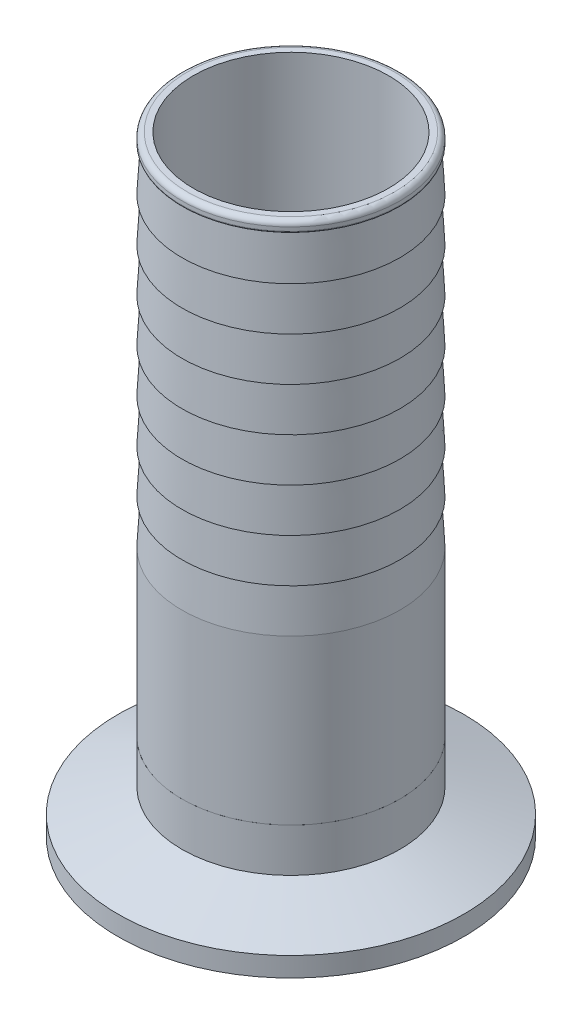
ISO-10303-21;
HEADER;
FILE_DESCRIPTION(('STEP AP214'),'2;1');
FILE_NAME('part.step','',(''),(''),'','','');
FILE_SCHEMA(('AUTOMOTIVE_DESIGN { 1 0 10303 214 1 1 1 1 }'));
ENDSEC;
DATA;
#1=APPLICATION_CONTEXT('core data for automotive mechanical design processes');
#2=APPLICATION_PROTOCOL_DEFINITION('international standard','automotive_design',2000,#1);
#3=PRODUCT_CONTEXT('',#1,'mechanical');
#4=PRODUCT('Part','Part','',(#3));
#5=PRODUCT_RELATED_PRODUCT_CATEGORY('part','',(#4));
#6=PRODUCT_DEFINITION_FORMATION('','',#4);
#7=PRODUCT_DEFINITION_CONTEXT('part definition',#1,'design');
#8=PRODUCT_DEFINITION('design','',#6,#7);
#9=PRODUCT_DEFINITION_SHAPE('','',#8);
#10=(LENGTH_UNIT() NAMED_UNIT(*) SI_UNIT(.MILLI.,.METRE.));
#11=(NAMED_UNIT(*) PLANE_ANGLE_UNIT() SI_UNIT($,.RADIAN.));
#12=(NAMED_UNIT(*) SI_UNIT($,.STERADIAN.) SOLID_ANGLE_UNIT());
#13=UNCERTAINTY_MEASURE_WITH_UNIT(LENGTH_MEASURE(1.E-05),#10,'distance_accuracy_value','');
#14=(GEOMETRIC_REPRESENTATION_CONTEXT(3) GLOBAL_UNCERTAINTY_ASSIGNED_CONTEXT((#13)) GLOBAL_UNIT_ASSIGNED_CONTEXT((#10,
#11,#12)) REPRESENTATION_CONTEXT('',''));
#15=CARTESIAN_POINT('',(0.,0.,0.));
#16=DIRECTION('',(0.,0.,1.));
#17=DIRECTION('',(1.,0.,0.));
#18=AXIS2_PLACEMENT_3D('',#15,#16,#17);
#19=CARTESIAN_POINT('',(26.6455914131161,25.0733038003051,37.8721007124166));
#20=DIRECTION('',(0.,-1.,0.));
#21=DIRECTION('',(0.,0.,-1.));
#22=AXIS2_PLACEMENT_3D('',#19,#20,#21);
#23=TOROIDAL_SURFACE('',#22,15.4178,1.1938);
#24=CARTESIAN_POINT('',(26.6455914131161,25.0733038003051,37.8721007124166));
#25=DIRECTION('',(0.,-1.,0.));
#26=DIRECTION('',(0.,0.,-1.));
#27=AXIS2_PLACEMENT_3D('',#24,#25,#26);
#28=CIRCLE('',#27,14.224);
#29=CARTESIAN_POINT('',(26.6455914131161,25.0733038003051,23.6481007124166));
#30=VERTEX_POINT('',#29);
#31=EDGE_CURVE('P0_E10',#30,#30,#28,.T.);
#32=ORIENTED_EDGE('',*,*,#31,.F.);
#33=EDGE_LOOP('',(#32));
#34=FACE_BOUND('',#33,.T.);
#35=CARTESIAN_POINT('',(26.6455914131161,24.2291597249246,37.8721007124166));
#36=DIRECTION('',(0.,-1.,0.));
#37=DIRECTION('',(0.,0.,-1.));
#38=AXIS2_PLACEMENT_3D('',#35,#36,#37);
#39=CIRCLE('',#38,14.5736559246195);
#40=CARTESIAN_POINT('',(26.6455914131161,24.2291597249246,23.2984447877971));
#41=VERTEX_POINT('',#40);
#42=EDGE_CURVE('P0_E64',#41,#41,#39,.T.);
#43=ORIENTED_EDGE('',*,*,#42,.T.);
#44=EDGE_LOOP('',(#43));
#45=FACE_BOUND('',#44,.T.);
#46=ADVANCED_FACE('P0_F15',(#34,#45),#23,.T.);
#47=CARTESIAN_POINT('',(26.6455914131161,21.4038156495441,37.8721007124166));
#48=DIRECTION('',(0.,-1.,0.));
#49=DIRECTION('',(0.,0.,-1.));
#50=AXIS2_PLACEMENT_3D('',#47,#48,#49);
#51=CYLINDRICAL_SURFACE('',#50,14.224);
#52=CARTESIAN_POINT('',(26.6455914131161,34.1038156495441,37.8721007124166));
#53=DIRECTION('',(0.,-1.,0.));
#54=DIRECTION('',(0.,0.,-1.));
#55=AXIS2_PLACEMENT_3D('',#52,#53,#54);
#56=CIRCLE('',#55,14.224);
#57=CARTESIAN_POINT('',(26.6455914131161,34.1038156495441,23.6481007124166));
#58=VERTEX_POINT('',#57);
#59=EDGE_CURVE('P0_E21',#58,#58,#56,.T.);
#60=ORIENTED_EDGE('',*,*,#59,.F.);
#61=EDGE_LOOP('',(#60));
#62=FACE_BOUND('',#61,.T.);
#63=ORIENTED_EDGE('',*,*,#31,.T.);
#64=EDGE_LOOP('',(#63));
#65=FACE_BOUND('',#64,.T.);
#66=ADVANCED_FACE('P0_F94',(#62,#65),#51,.F.);
#67=CARTESIAN_POINT('',(12.4215914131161,34.1038156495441,37.8721007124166));
#68=DIRECTION('',(0.,-1.,0.));
#69=DIRECTION('',(0.,0.,-1.));
#70=AXIS2_PLACEMENT_3D('',#67,#68,#69);
#71=PLANE('',#70);
#72=CARTESIAN_POINT('',(26.6455914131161,34.1038156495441,37.8721007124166));
#73=DIRECTION('',(0.,-1.,0.));
#74=DIRECTION('',(0.,0.,-1.));
#75=AXIS2_PLACEMENT_3D('',#72,#73,#74);
#76=CIRCLE('',#75,15.875);
#77=CARTESIAN_POINT('',(26.6455914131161,34.1038156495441,21.9971007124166));
#78=VERTEX_POINT('',#77);
#79=EDGE_CURVE('P0_E25',#78,#78,#76,.T.);
#80=ORIENTED_EDGE('',*,*,#79,.F.);
#81=EDGE_LOOP('',(#80));
#82=FACE_BOUND('',#81,.T.);
#83=ORIENTED_EDGE('',*,*,#59,.T.);
#84=EDGE_LOOP('',(#83));
#85=FACE_BOUND('',#84,.T.);
#86=ADVANCED_FACE('P0_F99',(#82,#85),#71,.F.);
#87=CARTESIAN_POINT('',(26.6455914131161,21.4038156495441,37.8721007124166));
#88=DIRECTION('',(0.,-1.,0.));
#89=DIRECTION('',(0.,0.,-1.));
#90=AXIS2_PLACEMENT_3D('',#87,#88,#89);
#91=CYLINDRICAL_SURFACE('',#90,15.875);
#92=CARTESIAN_POINT('',(26.6455914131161,27.7538156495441,37.8721007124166));
#93=DIRECTION('',(0.,-1.,0.));
#94=DIRECTION('',(0.,0.,-1.));
#95=AXIS2_PLACEMENT_3D('',#92,#93,#94);
#96=CIRCLE('',#95,15.875);
#97=CARTESIAN_POINT('',(26.6455914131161,27.7538156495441,21.9971007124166));
#98=VERTEX_POINT('',#97);
#99=EDGE_CURVE('P0_E29',#98,#98,#96,.T.);
#100=ORIENTED_EDGE('',*,*,#99,.F.);
#101=EDGE_LOOP('',(#100));
#102=FACE_BOUND('',#101,.T.);
#103=ORIENTED_EDGE('',*,*,#79,.T.);
#104=EDGE_LOOP('',(#103));
#105=FACE_BOUND('',#104,.T.);
#106=ADVANCED_FACE('P0_F104',(#102,#105),#91,.T.);
#107=CARTESIAN_POINT('',(10.7705914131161,27.7538156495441,37.8721007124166));
#108=DIRECTION('',(0.,1.,0.));
#109=DIRECTION('',(0.,0.,1.));
#110=AXIS2_PLACEMENT_3D('',#107,#108,#109);
#111=PLANE('',#110);
#112=CARTESIAN_POINT('',(26.6455914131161,27.7538156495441,37.8721007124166));
#113=DIRECTION('',(0.,-1.,0.));
#114=DIRECTION('',(0.,0.,-1.));
#115=AXIS2_PLACEMENT_3D('',#112,#113,#114);
#116=CIRCLE('',#115,15.5663421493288);
#117=CARTESIAN_POINT('',(26.6455914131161,27.7538156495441,22.3057585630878));
#118=VERTEX_POINT('',#117);
#119=EDGE_CURVE('P0_E34',#118,#118,#116,.T.);
#120=ORIENTED_EDGE('',*,*,#119,.F.);
#121=EDGE_LOOP('',(#120));
#122=FACE_BOUND('',#121,.T.);
#123=ORIENTED_EDGE('',*,*,#99,.T.);
#124=EDGE_LOOP('',(#123));
#125=FACE_BOUND('',#124,.T.);
#126=ADVANCED_FACE('P0_F110',(#122,#125),#111,.F.);
#127=CARTESIAN_POINT('',(26.6455914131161,27.7538156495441,37.8721007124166));
#128=DIRECTION('',(0.,-1.,0.));
#129=DIRECTION('',(0.,0.,-1.));
#130=AXIS2_PLACEMENT_3D('',#127,#128,#129);
#131=CONICAL_SURFACE('',#130,15.5663421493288,1.22173047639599);
#132=CARTESIAN_POINT('',(26.6455914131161,24.2486156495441,37.8721007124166));
#133=DIRECTION('',(0.,-1.,0.));
#134=DIRECTION('',(0.,0.,-1.));
#135=AXIS2_PLACEMENT_3D('',#132,#133,#134);
#136=CIRCLE('',#135,25.1968);
#137=CARTESIAN_POINT('',(26.6455914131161,24.2486156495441,12.6753007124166));
#138=VERTEX_POINT('',#137);
#139=EDGE_CURVE('P0_E37',#138,#138,#136,.T.);
#140=ORIENTED_EDGE('',*,*,#139,.F.);
#141=EDGE_LOOP('',(#140));
#142=FACE_BOUND('',#141,.T.);
#143=ORIENTED_EDGE('',*,*,#119,.T.);
#144=EDGE_LOOP('',(#143));
#145=FACE_BOUND('',#144,.T.);
#146=ADVANCED_FACE('P0_F114',(#142,#145),#131,.T.);
#147=CARTESIAN_POINT('',(26.6455914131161,21.4038156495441,37.8721007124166));
#148=DIRECTION('',(0.,-1.,0.));
#149=DIRECTION('',(0.,0.,-1.));
#150=AXIS2_PLACEMENT_3D('',#147,#148,#149);
#151=CYLINDRICAL_SURFACE('',#150,25.1968);
#152=CARTESIAN_POINT('',(26.6455914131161,21.4038156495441,37.8721007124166));
#153=DIRECTION('',(0.,-1.,0.));
#154=DIRECTION('',(0.,0.,-1.));
#155=AXIS2_PLACEMENT_3D('',#152,#153,#154);
#156=CIRCLE('',#155,25.1968);
#157=CARTESIAN_POINT('',(26.6455914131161,21.4038156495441,12.6753007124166));
#158=VERTEX_POINT('',#157);
#159=EDGE_CURVE('P0_E40',#158,#158,#156,.T.);
#160=ORIENTED_EDGE('',*,*,#159,.F.);
#161=EDGE_LOOP('',(#160));
#162=FACE_BOUND('',#161,.T.);
#163=ORIENTED_EDGE('',*,*,#139,.T.);
#164=EDGE_LOOP('',(#163));
#165=FACE_BOUND('',#164,.T.);
#166=ADVANCED_FACE('P0_F118',(#162,#165),#151,.T.);
#167=CARTESIAN_POINT('',(1.44879141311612,21.4038156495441,37.8721007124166));
#168=DIRECTION('',(0.,1.,0.));
#169=DIRECTION('',(0.,0.,1.));
#170=AXIS2_PLACEMENT_3D('',#167,#168,#169);
#171=PLANE('',#170);
#172=CARTESIAN_POINT('',(26.6455914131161,21.4038156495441,37.8721007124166));
#173=DIRECTION('',(0.,-1.,0.));
#174=DIRECTION('',(0.,0.,-1.));
#175=AXIS2_PLACEMENT_3D('',#172,#173,#174);
#176=CIRCLE('',#175,24.2165908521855);
#177=CARTESIAN_POINT('',(26.6455914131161,21.4038156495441,13.655509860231));
#178=VERTEX_POINT('',#177);
#179=EDGE_CURVE('P0_E43',#178,#178,#176,.T.);
#180=ORIENTED_EDGE('',*,*,#179,.F.);
#181=EDGE_LOOP('',(#180));
#182=FACE_BOUND('',#181,.T.);
#183=ORIENTED_EDGE('',*,*,#159,.T.);
#184=EDGE_LOOP('',(#183));
#185=FACE_BOUND('',#184,.T.);
#186=ADVANCED_FACE('P0_F122',(#182,#185),#171,.F.);
#187=CARTESIAN_POINT('',(26.6455914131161,22.1912156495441,37.8721007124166));
#188=DIRECTION('',(0.,-1.,0.));
#189=DIRECTION('',(0.,0.,-1.));
#190=AXIS2_PLACEMENT_3D('',#187,#188,#189);
#191=TOROIDAL_SURFACE('',#190,24.2165908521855,0.7874);
#192=ORIENTED_EDGE('',*,*,#179,.T.);
#193=EDGE_LOOP('',(#192));
#194=FACE_BOUND('',#193,.T.);
#195=CARTESIAN_POINT('',(26.6455914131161,21.6344397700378,37.8721007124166));
#196=DIRECTION('',(0.,-1.,0.));
#197=DIRECTION('',(0.,0.,-1.));
#198=AXIS2_PLACEMENT_3D('',#195,#196,#197);
#199=CIRCLE('',#198,23.6598149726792);
#200=CARTESIAN_POINT('',(26.6455914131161,21.6344397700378,14.2122857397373));
#201=VERTEX_POINT('',#200);
#202=EDGE_CURVE('P0_E46',#201,#201,#199,.T.);
#203=ORIENTED_EDGE('',*,*,#202,.F.);
#204=EDGE_LOOP('',(#203));
#205=FACE_BOUND('',#204,.T.);
#206=ADVANCED_FACE('P0_F126',(#194,#205),#191,.T.);
#207=CARTESIAN_POINT('',(26.6455914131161,21.6344397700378,37.8721007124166));
#208=DIRECTION('',(0.,-1.,0.));
#209=DIRECTION('',(0.,0.,-1.));
#210=AXIS2_PLACEMENT_3D('',#207,#208,#209);
#211=CONICAL_SURFACE('',#210,23.6598149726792,0.78539816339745);
#212=CARTESIAN_POINT('',(26.6455914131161,22.6315106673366,37.8721007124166));
#213=DIRECTION('',(0.,-1.,0.));
#214=DIRECTION('',(0.,0.,-1.));
#215=AXIS2_PLACEMENT_3D('',#212,#213,#214);
#216=CIRCLE('',#215,22.6627440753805);
#217=CARTESIAN_POINT('',(26.6455914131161,22.6315106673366,15.2093566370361));
#218=VERTEX_POINT('',#217);
#219=EDGE_CURVE('P0_E49',#218,#218,#216,.T.);
#220=ORIENTED_EDGE('',*,*,#219,.F.);
#221=EDGE_LOOP('',(#220));
#222=FACE_BOUND('',#221,.T.);
#223=ORIENTED_EDGE('',*,*,#202,.T.);
#224=EDGE_LOOP('',(#223));
#225=FACE_BOUND('',#224,.T.);
#226=ADVANCED_FACE('P0_F130',(#222,#225),#211,.F.);
#227=CARTESIAN_POINT('',(26.6455914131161,21.7873665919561,37.8721007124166));
#228=DIRECTION('',(0.,-1.,0.));
#229=DIRECTION('',(0.,0.,-1.));
#230=AXIS2_PLACEMENT_3D('',#227,#228,#229);
#231=TOROIDAL_SURFACE('',#230,21.8186,1.1938);
#232=ORIENTED_EDGE('',*,*,#219,.T.);
#233=EDGE_LOOP('',(#232));
#234=FACE_BOUND('',#233,.T.);
#235=CARTESIAN_POINT('',(26.6455914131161,22.1956702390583,37.8721007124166));
#236=DIRECTION('',(0.,-1.,0.));
#237=DIRECTION('',(0.,0.,-1.));
#238=AXIS2_PLACEMENT_3D('',#235,#236,#237);
#239=CIRCLE('',#238,20.6967949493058);
#240=CARTESIAN_POINT('',(26.6455914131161,22.1956702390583,17.1753057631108));
#241=VERTEX_POINT('',#240);
#242=EDGE_CURVE('P0_E52',#241,#241,#239,.T.);
#243=ORIENTED_EDGE('',*,*,#242,.F.);
#244=EDGE_LOOP('',(#243));
#245=FACE_BOUND('',#244,.T.);
#246=ADVANCED_FACE('P0_F90',(#234,#245),#231,.F.);
#247=CARTESIAN_POINT('',(26.6455914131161,22.1956702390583,37.8721007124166));
#248=DIRECTION('',(0.,1.,0.));
#249=DIRECTION('',(0.,0.,1.));
#250=AXIS2_PLACEMENT_3D('',#247,#248,#249);
#251=CONICAL_SURFACE('',#250,20.6967949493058,0.349065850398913);
#252=CARTESIAN_POINT('',(26.6455914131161,21.9219089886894,37.8721007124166));
#253=DIRECTION('',(0.,-1.,0.));
#254=DIRECTION('',(0.,0.,-1.));
#255=AXIS2_PLACEMENT_3D('',#252,#253,#254);
#256=CIRCLE('',#255,20.597154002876);
#257=CARTESIAN_POINT('',(26.6455914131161,21.9219089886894,17.2749467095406));
#258=VERTEX_POINT('',#257);
#259=EDGE_CURVE('P0_E55',#258,#258,#256,.T.);
#260=ORIENTED_EDGE('',*,*,#259,.F.);
#261=EDGE_LOOP('',(#260));
#262=FACE_BOUND('',#261,.T.);
#263=ORIENTED_EDGE('',*,*,#242,.T.);
#264=EDGE_LOOP('',(#263));
#265=FACE_BOUND('',#264,.T.);
#266=ADVANCED_FACE('P0_F83',(#262,#265),#251,.T.);
#267=CARTESIAN_POINT('',(26.6455914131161,22.1912156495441,37.8721007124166));
#268=DIRECTION('',(0.,-1.,0.));
#269=DIRECTION('',(0.,0.,-1.));
#270=AXIS2_PLACEMENT_3D('',#267,#268,#269);
#271=TOROIDAL_SURFACE('',#270,19.8572400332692,0.787399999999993);
#272=ORIENTED_EDGE('',*,*,#259,.T.);
#273=EDGE_LOOP('',(#272));
#274=FACE_BOUND('',#273,.T.);
#275=CARTESIAN_POINT('',(26.6455914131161,21.4038156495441,37.8721007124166));
#276=DIRECTION('',(0.,-1.,0.));
#277=DIRECTION('',(0.,0.,-1.));
#278=AXIS2_PLACEMENT_3D('',#275,#276,#277);
#279=CIRCLE('',#278,19.8572400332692);
#280=CARTESIAN_POINT('',(26.6455914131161,21.4038156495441,18.0148606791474));
#281=VERTEX_POINT('',#280);
#282=EDGE_CURVE('P0_E58',#281,#281,#279,.T.);
#283=ORIENTED_EDGE('',*,*,#282,.F.);
#284=EDGE_LOOP('',(#283));
#285=FACE_BOUND('',#284,.T.);
#286=ADVANCED_FACE('P0_F78',(#274,#285),#271,.T.);
#287=CARTESIAN_POINT('',(6.78835137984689,21.4038156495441,37.8721007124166));
#288=DIRECTION('',(0.,1.,0.));
#289=DIRECTION('',(0.,0.,1.));
#290=AXIS2_PLACEMENT_3D('',#287,#288,#289);
#291=PLANE('',#290);
#292=CARTESIAN_POINT('',(26.6455914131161,21.4038156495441,37.8721007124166));
#293=DIRECTION('',(0.,-1.,0.));
#294=DIRECTION('',(0.,0.,-1.));
#295=AXIS2_PLACEMENT_3D('',#292,#293,#294);
#296=CIRCLE('',#295,17.399);
#297=CARTESIAN_POINT('',(26.6455914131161,21.4038156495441,20.4731007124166));
#298=VERTEX_POINT('',#297);
#299=EDGE_CURVE('P0_E61',#298,#298,#296,.T.);
#300=ORIENTED_EDGE('',*,*,#299,.F.);
#301=EDGE_LOOP('',(#300));
#302=FACE_BOUND('',#301,.T.);
#303=ORIENTED_EDGE('',*,*,#282,.T.);
#304=EDGE_LOOP('',(#303));
#305=FACE_BOUND('',#304,.T.);
#306=ADVANCED_FACE('P0_F72',(#302,#305),#291,.F.);
#307=CARTESIAN_POINT('',(26.6455914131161,21.4038156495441,37.8721007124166));
#308=DIRECTION('',(0.,-1.,0.));
#309=DIRECTION('',(0.,0.,-1.));
#310=AXIS2_PLACEMENT_3D('',#307,#308,#309);
#311=CONICAL_SURFACE('',#310,17.399,0.78539816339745);
#312=ORIENTED_EDGE('',*,*,#42,.F.);
#313=EDGE_LOOP('',(#312));
#314=FACE_BOUND('',#313,.T.);
#315=ORIENTED_EDGE('',*,*,#299,.T.);
#316=EDGE_LOOP('',(#315));
#317=FACE_BOUND('',#316,.T.);
#318=ADVANCED_FACE('P0_F69',(#314,#317),#311,.F.);
#319=CLOSED_SHELL('',(#46,#66,#86,#106,#126,#146,#166,#186,#206,#226,#246,#266,#286,#306,#318));
#320=MANIFOLD_SOLID_BREP('P0_B1',#319);
#321=CARTESIAN_POINT('',(26.6455914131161,109.541815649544,37.8721007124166));
#322=DIRECTION('',(0.,-1.,0.));
#323=DIRECTION('',(0.556108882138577,0.,-0.831109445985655));
#324=AXIS2_PLACEMENT_3D('',#321,#322,#323);
#325=TOROIDAL_SURFACE('',#324,15.113,0.762000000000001);
#326=CARTESIAN_POINT('',(26.6455914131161,110.303815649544,37.8721007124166));
#327=DIRECTION('',(0.,-1.,0.));
#328=DIRECTION('',(0.556108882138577,0.,-0.831109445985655));
#329=AXIS2_PLACEMENT_3D('',#326,#327,#328);
#330=CIRCLE('',#329,15.113);
#331=CARTESIAN_POINT('',(35.0500649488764,110.303815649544,25.3115436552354));
#332=VERTEX_POINT('',#331);
#333=EDGE_CURVE('P1_E9',#332,#332,#330,.T.);
#334=ORIENTED_EDGE('',*,*,#333,.T.);
#335=EDGE_LOOP('',(#334));
#336=FACE_BOUND('',#335,.T.);
#337=CARTESIAN_POINT('',(26.6455914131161,109.541815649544,37.8721007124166));
#338=DIRECTION('',(0.,-1.,0.));
#339=DIRECTION('',(0.556108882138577,0.,-0.831109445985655));
#340=AXIS2_PLACEMENT_3D('',#337,#338,#339);
#341=CIRCLE('',#340,15.875);
#342=CARTESIAN_POINT('',(35.473819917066,109.541815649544,24.6782382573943));
#343=VERTEX_POINT('',#342);
#344=EDGE_CURVE('P1_E87',#343,#343,#341,.T.);
#345=ORIENTED_EDGE('',*,*,#344,.F.);
#346=EDGE_LOOP('',(#345));
#347=FACE_BOUND('',#346,.T.);
#348=ADVANCED_FACE('P1_F14',(#336,#347),#325,.T.);
#349=CARTESIAN_POINT('',(38.4672921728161,110.303815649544,45.7821934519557));
#350=DIRECTION('',(0.,1.,0.));
#351=DIRECTION('',(-0.556108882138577,0.,0.831109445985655));
#352=AXIS2_PLACEMENT_3D('',#349,#350,#351);
#353=PLANE('',#352);
#354=CARTESIAN_POINT('',(26.6455914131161,110.303815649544,37.8721007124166));
#355=DIRECTION('',(0.,-1.,0.));
#356=DIRECTION('',(0.556108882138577,0.,-0.831109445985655));
#357=AXIS2_PLACEMENT_3D('',#354,#355,#356);
#358=CIRCLE('',#357,14.224);
#359=CARTESIAN_POINT('',(34.5556841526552,110.303815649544,26.0503999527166));
#360=VERTEX_POINT('',#359);
#361=EDGE_CURVE('P1_E20',#360,#360,#358,.T.);
#362=ORIENTED_EDGE('',*,*,#361,.T.);
#363=EDGE_LOOP('',(#362));
#364=FACE_BOUND('',#363,.T.);
#365=ORIENTED_EDGE('',*,*,#333,.F.);
#366=EDGE_LOOP('',(#365));
#367=FACE_BOUND('',#366,.T.);
#368=ADVANCED_FACE('P1_F95',(#364,#367),#353,.T.);
#369=CARTESIAN_POINT('',(26.6455914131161,34.1038156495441,37.8721007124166));
#370=DIRECTION('',(0.,-1.,0.));
#371=DIRECTION('',(0.556108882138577,0.,-0.831109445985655));
#372=AXIS2_PLACEMENT_3D('',#369,#370,#371);
#373=CYLINDRICAL_SURFACE('',#372,14.224);
#374=CARTESIAN_POINT('',(26.6455914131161,34.1038156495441,37.8721007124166));
#375=DIRECTION('',(0.,-1.,0.));
#376=DIRECTION('',(0.556108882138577,0.,-0.831109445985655));
#377=AXIS2_PLACEMENT_3D('',#374,#375,#376);
#378=CIRCLE('',#377,14.224);
#379=CARTESIAN_POINT('',(34.5556841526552,34.1038156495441,26.0503999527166));
#380=VERTEX_POINT('',#379);
#381=EDGE_CURVE('P1_E24',#380,#380,#378,.T.);
#382=ORIENTED_EDGE('',*,*,#381,.T.);
#383=EDGE_LOOP('',(#382));
#384=FACE_BOUND('',#383,.T.);
#385=ORIENTED_EDGE('',*,*,#361,.F.);
#386=EDGE_LOOP('',(#385));
#387=FACE_BOUND('',#386,.T.);
#388=ADVANCED_FACE('P1_F100',(#384,#387),#373,.F.);
#389=CARTESIAN_POINT('',(39.8394538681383,34.1038156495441,46.7003292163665));
#390=DIRECTION('',(0.,-1.,0.));
#391=DIRECTION('',(0.556108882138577,0.,-0.831109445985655));
#392=AXIS2_PLACEMENT_3D('',#389,#390,#391);
#393=PLANE('',#392);
#394=CARTESIAN_POINT('',(26.6455914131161,34.1038156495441,37.8721007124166));
#395=DIRECTION('',(0.,-1.,0.));
#396=DIRECTION('',(0.556108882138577,0.,-0.831109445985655));
#397=AXIS2_PLACEMENT_3D('',#394,#395,#396);
#398=CIRCLE('',#397,15.875);
#399=CARTESIAN_POINT('',(35.473819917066,34.1038156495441,24.6782382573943));
#400=VERTEX_POINT('',#399);
#401=EDGE_CURVE('P1_E28',#400,#400,#398,.T.);
#402=ORIENTED_EDGE('',*,*,#401,.T.);
#403=EDGE_LOOP('',(#402));
#404=FACE_BOUND('',#403,.T.);
#405=ORIENTED_EDGE('',*,*,#381,.F.);
#406=EDGE_LOOP('',(#405));
#407=FACE_BOUND('',#406,.T.);
#408=ADVANCED_FACE('P1_F104',(#404,#407),#393,.T.);
#409=CARTESIAN_POINT('',(26.6455914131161,34.1038156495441,37.8721007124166));
#410=DIRECTION('',(0.,-1.,0.));
#411=DIRECTION('',(0.556108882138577,0.,-0.831109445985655));
#412=AXIS2_PLACEMENT_3D('',#409,#410,#411);
#413=CYLINDRICAL_SURFACE('',#412,15.875);
#414=CARTESIAN_POINT('',(26.6455914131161,57.9290156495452,37.8721007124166));
#415=DIRECTION('',(0.,-1.,0.));
#416=DIRECTION('',(0.556108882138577,0.,-0.831109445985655));
#417=AXIS2_PLACEMENT_3D('',#414,#415,#416);
#418=CIRCLE('',#417,15.875);
#419=CARTESIAN_POINT('',(35.473819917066,57.9290156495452,24.6782382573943));
#420=VERTEX_POINT('',#419);
#421=EDGE_CURVE('P1_E33',#420,#420,#418,.T.);
#422=ORIENTED_EDGE('',*,*,#421,.T.);
#423=EDGE_LOOP('',(#422));
#424=FACE_BOUND('',#423,.T.);
#425=ORIENTED_EDGE('',*,*,#401,.F.);
#426=EDGE_LOOP('',(#425));
#427=FACE_BOUND('',#426,.T.);
#428=ADVANCED_FACE('P1_F111',(#424,#427),#413,.T.);
#429=CARTESIAN_POINT('',(26.6455914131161,57.9290156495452,37.8721007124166));
#430=DIRECTION('',(0.,-1.,0.));
#431=DIRECTION('',(0.556108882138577,0.,-0.831109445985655));
#432=AXIS2_PLACEMENT_3D('',#429,#430,#431);
#433=CONICAL_SURFACE('',#432,15.875,0.0599281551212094);
#434=CARTESIAN_POINT('',(26.6455914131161,64.279015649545,37.8721007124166));
#435=DIRECTION('',(0.,-1.,0.));
#436=DIRECTION('',(0.556108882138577,0.,-0.831109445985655));
#437=AXIS2_PLACEMENT_3D('',#434,#435,#436);
#438=CIRCLE('',#437,15.494);
#439=CARTESIAN_POINT('',(35.2619424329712,64.279015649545,24.9948909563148));
#440=VERTEX_POINT('',#439);
#441=EDGE_CURVE('P1_E36',#440,#440,#438,.T.);
#442=ORIENTED_EDGE('',*,*,#441,.T.);
#443=EDGE_LOOP('',(#442));
#444=FACE_BOUND('',#443,.T.);
#445=ORIENTED_EDGE('',*,*,#421,.F.);
#446=EDGE_LOOP('',(#445));
#447=FACE_BOUND('',#446,.T.);
#448=ADVANCED_FACE('P1_F115',(#444,#447),#433,.T.);
#449=CARTESIAN_POINT('',(39.8394538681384,64.279015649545,46.7003292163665));
#450=DIRECTION('',(0.,-1.,0.));
#451=DIRECTION('',(0.556108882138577,0.,-0.831109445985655));
#452=AXIS2_PLACEMENT_3D('',#449,#450,#451);
#453=PLANE('',#452);
#454=CARTESIAN_POINT('',(26.6455914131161,64.279015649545,37.8721007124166));
#455=DIRECTION('',(0.,-1.,0.));
#456=DIRECTION('',(0.556108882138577,0.,-0.831109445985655));
#457=AXIS2_PLACEMENT_3D('',#454,#455,#456);
#458=CIRCLE('',#457,15.875);
#459=CARTESIAN_POINT('',(35.473819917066,64.279015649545,24.6782382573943));
#460=VERTEX_POINT('',#459);
#461=EDGE_CURVE('P1_E39',#460,#460,#458,.T.);
#462=ORIENTED_EDGE('',*,*,#461,.T.);
#463=EDGE_LOOP('',(#462));
#464=FACE_BOUND('',#463,.T.);
#465=ORIENTED_EDGE('',*,*,#441,.F.);
#466=EDGE_LOOP('',(#465));
#467=FACE_BOUND('',#466,.T.);
#468=ADVANCED_FACE('P1_F119',(#464,#467),#453,.T.);
#469=CARTESIAN_POINT('',(26.6455914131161,64.279015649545,37.8721007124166));
#470=DIRECTION('',(0.,-1.,0.));
#471=DIRECTION('',(0.556108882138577,0.,-0.831109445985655));
#472=AXIS2_PLACEMENT_3D('',#469,#470,#471);
#473=CONICAL_SURFACE('',#472,15.875,0.059928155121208);
#474=CARTESIAN_POINT('',(26.6455914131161,70.629015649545,37.8721007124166));
#475=DIRECTION('',(0.,-1.,0.));
#476=DIRECTION('',(0.556108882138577,0.,-0.831109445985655));
#477=AXIS2_PLACEMENT_3D('',#474,#475,#476);
#478=CIRCLE('',#477,15.494);
#479=CARTESIAN_POINT('',(35.2619424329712,70.629015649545,24.9948909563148));
#480=VERTEX_POINT('',#479);
#481=EDGE_CURVE('P1_E42',#480,#480,#478,.T.);
#482=ORIENTED_EDGE('',*,*,#481,.T.);
#483=EDGE_LOOP('',(#482));
#484=FACE_BOUND('',#483,.T.);
#485=ORIENTED_EDGE('',*,*,#461,.F.);
#486=EDGE_LOOP('',(#485));
#487=FACE_BOUND('',#486,.T.);
#488=ADVANCED_FACE('P1_F123',(#484,#487),#473,.T.);
#489=CARTESIAN_POINT('',(39.8394538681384,70.629015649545,46.7003292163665));
#490=DIRECTION('',(0.,-1.,0.));
#491=DIRECTION('',(0.556108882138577,0.,-0.831109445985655));
#492=AXIS2_PLACEMENT_3D('',#489,#490,#491);
#493=PLANE('',#492);
#494=CARTESIAN_POINT('',(26.6455914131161,70.629015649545,37.8721007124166));
#495=DIRECTION('',(0.,-1.,0.));
#496=DIRECTION('',(0.556108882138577,0.,-0.831109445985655));
#497=AXIS2_PLACEMENT_3D('',#494,#495,#496);
#498=CIRCLE('',#497,15.875);
#499=CARTESIAN_POINT('',(35.473819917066,70.629015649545,24.6782382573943));
#500=VERTEX_POINT('',#499);
#501=EDGE_CURVE('P1_E45',#500,#500,#498,.T.);
#502=ORIENTED_EDGE('',*,*,#501,.T.);
#503=EDGE_LOOP('',(#502));
#504=FACE_BOUND('',#503,.T.);
#505=ORIENTED_EDGE('',*,*,#481,.F.);
#506=EDGE_LOOP('',(#505));
#507=FACE_BOUND('',#506,.T.);
#508=ADVANCED_FACE('P1_F127',(#504,#507),#493,.T.);
#509=CARTESIAN_POINT('',(26.6455914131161,70.629015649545,37.8721007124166));
#510=DIRECTION('',(0.,-1.,0.));
#511=DIRECTION('',(0.556108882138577,0.,-0.831109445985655));
#512=AXIS2_PLACEMENT_3D('',#509,#510,#511);
#513=CONICAL_SURFACE('',#512,15.875,0.0599281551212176);
#514=CARTESIAN_POINT('',(26.6455914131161,76.9790156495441,37.8721007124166));
#515=DIRECTION('',(0.,-1.,0.));
#516=DIRECTION('',(0.556108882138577,0.,-0.831109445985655));
#517=AXIS2_PLACEMENT_3D('',#514,#515,#516);
#518=CIRCLE('',#517,15.494);
#519=CARTESIAN_POINT('',(35.2619424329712,76.9790156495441,24.9948909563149));
#520=VERTEX_POINT('',#519);
#521=EDGE_CURVE('P1_E48',#520,#520,#518,.T.);
#522=ORIENTED_EDGE('',*,*,#521,.T.);
#523=EDGE_LOOP('',(#522));
#524=FACE_BOUND('',#523,.T.);
#525=ORIENTED_EDGE('',*,*,#501,.F.);
#526=EDGE_LOOP('',(#525));
#527=FACE_BOUND('',#526,.T.);
#528=ADVANCED_FACE('P1_F131',(#524,#527),#513,.T.);
#529=CARTESIAN_POINT('',(39.8394538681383,76.9790156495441,46.7003292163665));
#530=DIRECTION('',(0.,-1.,0.));
#531=DIRECTION('',(0.556108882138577,0.,-0.831109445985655));
#532=AXIS2_PLACEMENT_3D('',#529,#530,#531);
#533=PLANE('',#532);
#534=CARTESIAN_POINT('',(26.6455914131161,76.9790156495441,37.8721007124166));
#535=DIRECTION('',(0.,-1.,0.));
#536=DIRECTION('',(0.556108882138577,0.,-0.831109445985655));
#537=AXIS2_PLACEMENT_3D('',#534,#535,#536);
#538=CIRCLE('',#537,15.875);
#539=CARTESIAN_POINT('',(35.473819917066,76.9790156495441,24.6782382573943));
#540=VERTEX_POINT('',#539);
#541=EDGE_CURVE('P1_E51',#540,#540,#538,.T.);
#542=ORIENTED_EDGE('',*,*,#541,.T.);
#543=EDGE_LOOP('',(#542));
#544=FACE_BOUND('',#543,.T.);
#545=ORIENTED_EDGE('',*,*,#521,.F.);
#546=EDGE_LOOP('',(#545));
#547=FACE_BOUND('',#546,.T.);
#548=ADVANCED_FACE('P1_F135',(#544,#547),#533,.T.);
#549=CARTESIAN_POINT('',(26.6455914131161,76.9790156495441,37.8721007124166));
#550=DIRECTION('',(0.,-1.,0.));
#551=DIRECTION('',(0.556108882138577,0.,-0.831109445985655));
#552=AXIS2_PLACEMENT_3D('',#549,#550,#551);
#553=CONICAL_SURFACE('',#552,15.875,0.0599281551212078);
#554=CARTESIAN_POINT('',(26.6455914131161,83.3290156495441,37.8721007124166));
#555=DIRECTION('',(0.,-1.,0.));
#556=DIRECTION('',(0.556108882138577,0.,-0.831109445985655));
#557=AXIS2_PLACEMENT_3D('',#554,#555,#556);
#558=CIRCLE('',#557,15.494);
#559=CARTESIAN_POINT('',(35.2619424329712,83.3290156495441,24.9948909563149));
#560=VERTEX_POINT('',#559);
#561=EDGE_CURVE('P1_E54',#560,#560,#558,.T.);
#562=ORIENTED_EDGE('',*,*,#561,.T.);
#563=EDGE_LOOP('',(#562));
#564=FACE_BOUND('',#563,.T.);
#565=ORIENTED_EDGE('',*,*,#541,.F.);
#566=EDGE_LOOP('',(#565));
#567=FACE_BOUND('',#566,.T.);
#568=ADVANCED_FACE('P1_F139',(#564,#567),#553,.T.);
#569=CARTESIAN_POINT('',(39.8394538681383,83.3290156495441,46.7003292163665));
#570=DIRECTION('',(0.,-1.,0.));
#571=DIRECTION('',(0.556108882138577,0.,-0.831109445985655));
#572=AXIS2_PLACEMENT_3D('',#569,#570,#571);
#573=PLANE('',#572);
#574=CARTESIAN_POINT('',(26.6455914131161,83.3290156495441,37.8721007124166));
#575=DIRECTION('',(0.,-1.,0.));
#576=DIRECTION('',(0.556108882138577,0.,-0.831109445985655));
#577=AXIS2_PLACEMENT_3D('',#574,#575,#576);
#578=CIRCLE('',#577,15.875);
#579=CARTESIAN_POINT('',(35.473819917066,83.3290156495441,24.6782382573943));
#580=VERTEX_POINT('',#579);
#581=EDGE_CURVE('P1_E57',#580,#580,#578,.T.);
#582=ORIENTED_EDGE('',*,*,#581,.T.);
#583=EDGE_LOOP('',(#582));
#584=FACE_BOUND('',#583,.T.);
#585=ORIENTED_EDGE('',*,*,#561,.F.);
#586=EDGE_LOOP('',(#585));
#587=FACE_BOUND('',#586,.T.);
#588=ADVANCED_FACE('P1_F143',(#584,#587),#573,.T.);
#589=CARTESIAN_POINT('',(26.6455914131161,83.3290156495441,37.8721007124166));
#590=DIRECTION('',(0.,-1.,0.));
#591=DIRECTION('',(0.556108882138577,0.,-0.831109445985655));
#592=AXIS2_PLACEMENT_3D('',#589,#590,#591);
#593=CONICAL_SURFACE('',#592,15.875,0.0599281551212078);
#594=CARTESIAN_POINT('',(26.6455914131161,89.6790156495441,37.8721007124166));
#595=DIRECTION('',(0.,-1.,0.));
#596=DIRECTION('',(0.556108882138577,0.,-0.831109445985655));
#597=AXIS2_PLACEMENT_3D('',#594,#595,#596);
#598=CIRCLE('',#597,15.494);
#599=CARTESIAN_POINT('',(35.2619424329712,89.6790156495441,24.9948909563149));
#600=VERTEX_POINT('',#599);
#601=EDGE_CURVE('P1_E60',#600,#600,#598,.T.);
#602=ORIENTED_EDGE('',*,*,#601,.T.);
#603=EDGE_LOOP('',(#602));
#604=FACE_BOUND('',#603,.T.);
#605=ORIENTED_EDGE('',*,*,#581,.F.);
#606=EDGE_LOOP('',(#605));
#607=FACE_BOUND('',#606,.T.);
#608=ADVANCED_FACE('P1_F147',(#604,#607),#593,.T.);
#609=CARTESIAN_POINT('',(39.8394538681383,89.6790156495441,46.7003292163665));
#610=DIRECTION('',(0.,-1.,0.));
#611=DIRECTION('',(0.556108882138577,0.,-0.831109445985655));
#612=AXIS2_PLACEMENT_3D('',#609,#610,#611);
#613=PLANE('',#612);
#614=CARTESIAN_POINT('',(26.6455914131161,89.6790156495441,37.8721007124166));
#615=DIRECTION('',(0.,-1.,0.));
#616=DIRECTION('',(0.556108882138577,0.,-0.831109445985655));
#617=AXIS2_PLACEMENT_3D('',#614,#615,#616);
#618=CIRCLE('',#617,15.875);
#619=CARTESIAN_POINT('',(35.473819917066,89.6790156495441,24.6782382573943));
#620=VERTEX_POINT('',#619);
#621=EDGE_CURVE('P1_E63',#620,#620,#618,.T.);
#622=ORIENTED_EDGE('',*,*,#621,.T.);
#623=EDGE_LOOP('',(#622));
#624=FACE_BOUND('',#623,.T.);
#625=ORIENTED_EDGE('',*,*,#601,.F.);
#626=EDGE_LOOP('',(#625));
#627=FACE_BOUND('',#626,.T.);
#628=ADVANCED_FACE('P1_F151',(#624,#627),#613,.T.);
#629=CARTESIAN_POINT('',(26.6455914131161,89.6790156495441,37.8721007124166));
#630=DIRECTION('',(0.,-1.,0.));
#631=DIRECTION('',(0.556108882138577,0.,-0.831109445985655));
#632=AXIS2_PLACEMENT_3D('',#629,#630,#631);
#633=CONICAL_SURFACE('',#632,15.875,0.0599281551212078);
#634=CARTESIAN_POINT('',(26.6455914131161,96.0290156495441,37.8721007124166));
#635=DIRECTION('',(0.,-1.,0.));
#636=DIRECTION('',(0.556108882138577,0.,-0.831109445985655));
#637=AXIS2_PLACEMENT_3D('',#634,#635,#636);
#638=CIRCLE('',#637,15.494);
#639=CARTESIAN_POINT('',(35.2619424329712,96.0290156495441,24.9948909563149));
#640=VERTEX_POINT('',#639);
#641=EDGE_CURVE('P1_E66',#640,#640,#638,.T.);
#642=ORIENTED_EDGE('',*,*,#641,.T.);
#643=EDGE_LOOP('',(#642));
#644=FACE_BOUND('',#643,.T.);
#645=ORIENTED_EDGE('',*,*,#621,.F.);
#646=EDGE_LOOP('',(#645));
#647=FACE_BOUND('',#646,.T.);
#648=ADVANCED_FACE('P1_F155',(#644,#647),#633,.T.);
#649=CARTESIAN_POINT('',(39.8394538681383,96.0290156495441,46.7003292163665));
#650=DIRECTION('',(0.,-1.,0.));
#651=DIRECTION('',(0.556108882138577,0.,-0.831109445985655));
#652=AXIS2_PLACEMENT_3D('',#649,#650,#651);
#653=PLANE('',#652);
#654=CARTESIAN_POINT('',(26.6455914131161,96.0290156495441,37.8721007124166));
#655=DIRECTION('',(0.,-1.,0.));
#656=DIRECTION('',(0.556108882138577,0.,-0.831109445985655));
#657=AXIS2_PLACEMENT_3D('',#654,#655,#656);
#658=CIRCLE('',#657,15.875);
#659=CARTESIAN_POINT('',(35.473819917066,96.0290156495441,24.6782382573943));
#660=VERTEX_POINT('',#659);
#661=EDGE_CURVE('P1_E69',#660,#660,#658,.T.);
#662=ORIENTED_EDGE('',*,*,#661,.T.);
#663=EDGE_LOOP('',(#662));
#664=FACE_BOUND('',#663,.T.);
#665=ORIENTED_EDGE('',*,*,#641,.F.);
#666=EDGE_LOOP('',(#665));
#667=FACE_BOUND('',#666,.T.);
#668=ADVANCED_FACE('P1_F159',(#664,#667),#653,.T.);
#669=CARTESIAN_POINT('',(26.6455914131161,96.0290156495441,37.8721007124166));
#670=DIRECTION('',(0.,-1.,0.));
#671=DIRECTION('',(0.556108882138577,0.,-0.831109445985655));
#672=AXIS2_PLACEMENT_3D('',#669,#670,#671);
#673=CONICAL_SURFACE('',#672,15.875,0.0599281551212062);
#674=CARTESIAN_POINT('',(26.6455914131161,102.379015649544,37.8721007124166));
#675=DIRECTION('',(0.,-1.,0.));
#676=DIRECTION('',(0.556108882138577,0.,-0.831109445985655));
#677=AXIS2_PLACEMENT_3D('',#674,#675,#676);
#678=CIRCLE('',#677,15.494);
#679=CARTESIAN_POINT('',(35.2619424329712,102.379015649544,24.9948909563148));
#680=VERTEX_POINT('',#679);
#681=EDGE_CURVE('P1_E72',#680,#680,#678,.T.);
#682=ORIENTED_EDGE('',*,*,#681,.T.);
#683=EDGE_LOOP('',(#682));
#684=FACE_BOUND('',#683,.T.);
#685=ORIENTED_EDGE('',*,*,#661,.F.);
#686=EDGE_LOOP('',(#685));
#687=FACE_BOUND('',#686,.T.);
#688=ADVANCED_FACE('P1_F163',(#684,#687),#673,.T.);
#689=CARTESIAN_POINT('',(39.8394538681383,102.379015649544,46.7003292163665));
#690=DIRECTION('',(0.,-1.,0.));
#691=DIRECTION('',(0.556108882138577,0.,-0.831109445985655));
#692=AXIS2_PLACEMENT_3D('',#689,#690,#691);
#693=PLANE('',#692);
#694=CARTESIAN_POINT('',(26.6455914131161,102.379015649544,37.8721007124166));
#695=DIRECTION('',(0.,-1.,0.));
#696=DIRECTION('',(0.556108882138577,0.,-0.831109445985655));
#697=AXIS2_PLACEMENT_3D('',#694,#695,#696);
#698=CIRCLE('',#697,15.875);
#699=CARTESIAN_POINT('',(35.473819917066,102.379015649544,24.6782382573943));
#700=VERTEX_POINT('',#699);
#701=EDGE_CURVE('P1_E75',#700,#700,#698,.T.);
#702=ORIENTED_EDGE('',*,*,#701,.T.);
#703=EDGE_LOOP('',(#702));
#704=FACE_BOUND('',#703,.T.);
#705=ORIENTED_EDGE('',*,*,#681,.F.);
#706=EDGE_LOOP('',(#705));
#707=FACE_BOUND('',#706,.T.);
#708=ADVANCED_FACE('P1_F167',(#704,#707),#693,.T.);
#709=CARTESIAN_POINT('',(26.6455914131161,102.379015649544,37.8721007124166));
#710=DIRECTION('',(0.,-1.,0.));
#711=DIRECTION('',(0.556108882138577,0.,-0.831109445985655));
#712=AXIS2_PLACEMENT_3D('',#709,#710,#711);
#713=CONICAL_SURFACE('',#712,15.875,0.0599281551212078);
#714=CARTESIAN_POINT('',(26.6455914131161,108.729015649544,37.8721007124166));
#715=DIRECTION('',(0.,-1.,0.));
#716=DIRECTION('',(0.556108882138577,0.,-0.831109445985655));
#717=AXIS2_PLACEMENT_3D('',#714,#715,#716);
#718=CIRCLE('',#717,15.494);
#719=CARTESIAN_POINT('',(35.2619424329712,108.729015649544,24.9948909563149));
#720=VERTEX_POINT('',#719);
#721=EDGE_CURVE('P1_E78',#720,#720,#718,.T.);
#722=ORIENTED_EDGE('',*,*,#721,.T.);
#723=EDGE_LOOP('',(#722));
#724=FACE_BOUND('',#723,.T.);
#725=ORIENTED_EDGE('',*,*,#701,.F.);
#726=EDGE_LOOP('',(#725));
#727=FACE_BOUND('',#726,.T.);
#728=ADVANCED_FACE('P1_F171',(#724,#727),#713,.T.);
#729=CARTESIAN_POINT('',(39.6283520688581,108.729015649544,46.5590775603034));
#730=DIRECTION('',(0.,-1.,0.));
#731=DIRECTION('',(0.556108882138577,0.,-0.831109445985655));
#732=AXIS2_PLACEMENT_3D('',#729,#730,#731);
#733=PLANE('',#732);
#734=CARTESIAN_POINT('',(26.6455914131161,108.729015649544,37.8721007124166));
#735=DIRECTION('',(0.,-1.,0.));
#736=DIRECTION('',(0.556108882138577,0.,-0.831109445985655));
#737=AXIS2_PLACEMENT_3D('',#734,#735,#736);
#738=CIRCLE('',#737,15.6210000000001);
#739=CARTESIAN_POINT('',(35.3325682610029,108.729015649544,24.8893400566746));
#740=VERTEX_POINT('',#739);
#741=EDGE_CURVE('P1_E81',#740,#740,#738,.T.);
#742=ORIENTED_EDGE('',*,*,#741,.T.);
#743=EDGE_LOOP('',(#742));
#744=FACE_BOUND('',#743,.T.);
#745=ORIENTED_EDGE('',*,*,#721,.F.);
#746=EDGE_LOOP('',(#745));
#747=FACE_BOUND('',#746,.T.);
#748=ADVANCED_FACE('P1_F175',(#744,#747),#733,.T.);
#749=CARTESIAN_POINT('',(26.6455914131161,108.983015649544,37.8721007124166));
#750=DIRECTION('',(0.,-1.,0.));
#751=DIRECTION('',(0.556108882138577,0.,-0.831109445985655));
#752=AXIS2_PLACEMENT_3D('',#749,#750,#751);
#753=TOROIDAL_SURFACE('',#752,15.621,0.254000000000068);
#754=CARTESIAN_POINT('',(26.6455914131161,108.983015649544,37.8721007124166));
#755=DIRECTION('',(0.,-1.,0.));
#756=DIRECTION('',(0.556108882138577,0.,-0.831109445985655));
#757=AXIS2_PLACEMENT_3D('',#754,#755,#756);
#758=CIRCLE('',#757,15.875);
#759=CARTESIAN_POINT('',(35.473819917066,108.983015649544,24.6782382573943));
#760=VERTEX_POINT('',#759);
#761=EDGE_CURVE('P1_E84',#760,#760,#758,.T.);
#762=ORIENTED_EDGE('',*,*,#761,.T.);
#763=EDGE_LOOP('',(#762));
#764=FACE_BOUND('',#763,.T.);
#765=ORIENTED_EDGE('',*,*,#741,.F.);
#766=EDGE_LOOP('',(#765));
#767=FACE_BOUND('',#766,.T.);
#768=ADVANCED_FACE('P1_F179',(#764,#767),#753,.T.);
#769=CARTESIAN_POINT('',(26.6455914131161,34.1038156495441,37.8721007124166));
#770=DIRECTION('',(0.,-1.,0.));
#771=DIRECTION('',(0.556108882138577,0.,-0.831109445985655));
#772=AXIS2_PLACEMENT_3D('',#769,#770,#771);
#773=CYLINDRICAL_SURFACE('',#772,15.875);
#774=ORIENTED_EDGE('',*,*,#344,.T.);
#775=EDGE_LOOP('',(#774));
#776=FACE_BOUND('',#775,.T.);
#777=ORIENTED_EDGE('',*,*,#761,.F.);
#778=EDGE_LOOP('',(#777));
#779=FACE_BOUND('',#778,.T.);
#780=ADVANCED_FACE('P1_F91',(#776,#779),#773,.T.);
#781=CLOSED_SHELL('',(#348,#368,#388,#408,#428,#448,#468,#488,#508,#528,#548,#568,#588,#608,
#628,#648,#668,#688,#708,#728,#748,#768,#780));
#782=MANIFOLD_SOLID_BREP('P1_B1',#781);
#783=ADVANCED_BREP_SHAPE_REPRESENTATION('',(#18,#320,#782),#14);
#784=SHAPE_DEFINITION_REPRESENTATION(#9,#783);
ENDSEC;
END-ISO-10303-21;
